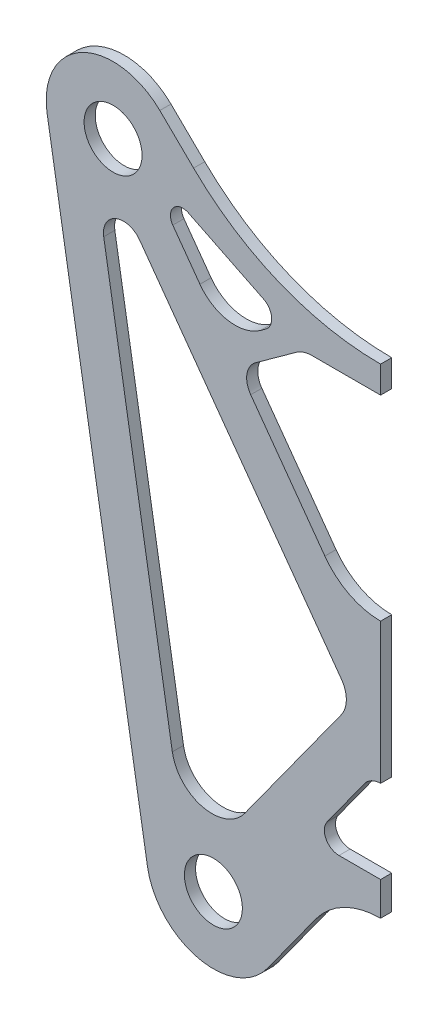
ISO-10303-21;
HEADER;
FILE_DESCRIPTION(('STEP AP214'),'2;1');
FILE_NAME('part.step','',(''),(''),'','','');
FILE_SCHEMA(('AUTOMOTIVE_DESIGN { 1 0 10303 214 1 1 1 1 }'));
ENDSEC;
DATA;
#1=APPLICATION_CONTEXT('core data for automotive mechanical design processes');
#2=APPLICATION_PROTOCOL_DEFINITION('international standard','automotive_design',2000,#1);
#3=PRODUCT_CONTEXT('',#1,'mechanical');
#4=PRODUCT('Part','Part','',(#3));
#5=PRODUCT_RELATED_PRODUCT_CATEGORY('part','',(#4));
#6=PRODUCT_DEFINITION_FORMATION('','',#4);
#7=PRODUCT_DEFINITION_CONTEXT('part definition',#1,'design');
#8=PRODUCT_DEFINITION('design','',#6,#7);
#9=PRODUCT_DEFINITION_SHAPE('','',#8);
#10=(LENGTH_UNIT() NAMED_UNIT(*) SI_UNIT(.MILLI.,.METRE.));
#11=(NAMED_UNIT(*) PLANE_ANGLE_UNIT() SI_UNIT($,.RADIAN.));
#12=(NAMED_UNIT(*) SI_UNIT($,.STERADIAN.) SOLID_ANGLE_UNIT());
#13=UNCERTAINTY_MEASURE_WITH_UNIT(LENGTH_MEASURE(1.E-05),#10,'distance_accuracy_value','');
#14=(GEOMETRIC_REPRESENTATION_CONTEXT(3) GLOBAL_UNCERTAINTY_ASSIGNED_CONTEXT((#13)) GLOBAL_UNIT_ASSIGNED_CONTEXT((#10,
#11,#12)) REPRESENTATION_CONTEXT('',''));
#15=CARTESIAN_POINT('',(0.,0.,0.));
#16=DIRECTION('',(0.,0.,1.));
#17=DIRECTION('',(1.,0.,0.));
#18=AXIS2_PLACEMENT_3D('',#15,#16,#17);
#19=CARTESIAN_POINT('',(-188.917466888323,32.6227205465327,5.));
#20=DIRECTION('',(0.,0.,-1.));
#21=DIRECTION('',(-1.,0.,0.));
#22=AXIS2_PLACEMENT_3D('',#19,#20,#21);
#23=PLANE('',#22);
#24=CARTESIAN_POINT('',(-157.627108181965,15.7153193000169,5.));
#25=DIRECTION('',(0.,0.,1.));
#26=DIRECTION('',(-1.,0.,0.));
#27=AXIS2_PLACEMENT_3D('',#24,#25,#26);
#28=CIRCLE('',#27,5.56609009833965);
#29=CARTESIAN_POINT('',(-155.167864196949,20.7086626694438,5.));
#30=VERTEX_POINT('',#29);
#31=CARTESIAN_POINT('',(-162.139421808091,12.4564261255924,5.));
#32=VERTEX_POINT('',#31);
#33=EDGE_CURVE('E291',#30,#32,#28,.T.);
#34=ORIENTED_EDGE('',*,*,#33,.F.);
#35=DIRECTION('',(-0.89710070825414,0.441826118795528,0.));
#36=VECTOR('',#35,1.);
#37=CARTESIAN_POINT('',(-155.167864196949,20.7086626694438,5.));
#38=LINE('',#37,#36);
#39=CARTESIAN_POINT('',(-121.443837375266,4.09942833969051,5.));
#40=VERTEX_POINT('',#39);
#41=EDGE_CURVE('E303',#40,#30,#38,.T.);
#42=ORIENTED_EDGE('',*,*,#41,.F.);
#43=CARTESIAN_POINT('',(-124.352985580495,-1.80741782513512,5.));
#44=DIRECTION('',(0.,0.,1.));
#45=DIRECTION('',(-1.,0.,0.));
#46=AXIS2_PLACEMENT_3D('',#43,#44,#45);
#47=CIRCLE('',#46,6.58437353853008);
#48=CARTESIAN_POINT('',(-120.497897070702,-7.14523268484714,5.));
#49=VERTEX_POINT('',#48);
#50=EDGE_CURVE('E300',#49,#40,#47,.T.);
#51=ORIENTED_EDGE('',*,*,#50,.F.);
#52=DIRECTION('',(0.81067922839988,0.585490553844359,0.));
#53=VECTOR('',#52,1.);
#54=CARTESIAN_POINT('',(-120.497897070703,-7.14523268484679,5.));
#55=LINE('',#54,#53);
#56=CARTESIAN_POINT('',(-122.787009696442,-8.79848069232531,5.));
#57=VERTEX_POINT('',#56);
#58=EDGE_CURVE('E298',#57,#49,#55,.T.);
#59=ORIENTED_EDGE('',*,*,#58,.F.);
#60=CARTESIAN_POINT('',(-134.179271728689,6.9754205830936,5.));
#61=DIRECTION('',(0.,0.,1.));
#62=DIRECTION('',(-1.,0.,0.));
#63=AXIS2_PLACEMENT_3D('',#60,#61,#62);
#64=CIRCLE('',#63,19.4576359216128);
#65=CARTESIAN_POINT('',(-149.953173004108,-4.41684144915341,5.));
#66=VERTEX_POINT('',#65);
#67=EDGE_CURVE('E296',#66,#57,#64,.T.);
#68=ORIENTED_EDGE('',*,*,#67,.F.);
#69=DIRECTION('',(0.585490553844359,-0.81067922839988,0.));
#70=VECTOR('',#69,1.);
#71=CARTESIAN_POINT('',(-149.953173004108,-4.4168414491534,5.));
#72=LINE('',#71,#70);
#73=EDGE_CURVE('E293',#32,#66,#72,.T.);
#74=ORIENTED_EDGE('',*,*,#73,.F.);
#75=EDGE_LOOP('',(#34,#42,#51,#59,#68,#74));
#76=FACE_BOUND('',#75,.T.);
#77=CARTESIAN_POINT('',(-188.917466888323,32.6227205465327,5.));
#78=DIRECTION('',(0.,0.,1.));
#79=DIRECTION('',(1.,0.,0.));
#80=AXIS2_PLACEMENT_3D('',#77,#78,#79);
#81=CIRCLE('',#80,13.0000000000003);
#82=CARTESIAN_POINT('',(-175.917466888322,32.6227205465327,5.));
#83=VERTEX_POINT('',#82);
#84=EDGE_CURVE('E342',#83,#83,#81,.T.);
#85=ORIENTED_EDGE('',*,*,#84,.F.);
#86=EDGE_LOOP('',(#85));
#87=FACE_BOUND('',#86,.T.);
#88=CARTESIAN_POINT('',(-188.917466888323,32.6227205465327,5.));
#89=DIRECTION('',(0.,0.,1.));
#90=DIRECTION('',(-1.,0.,0.));
#91=AXIS2_PLACEMENT_3D('',#88,#89,#90);
#92=CIRCLE('',#91,29.9999999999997);
#93=CARTESIAN_POINT('',(-167.942066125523,54.071090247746,5.));
#94=VERTEX_POINT('',#93);
#95=CARTESIAN_POINT('',(-218.509284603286,27.6907509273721,5.));
#96=VERTEX_POINT('',#95);
#97=EDGE_CURVE('E348',#94,#96,#92,.T.);
#98=ORIENTED_EDGE('',*,*,#97,.T.);
#99=DIRECTION('',(0.164398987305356,-0.986393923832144,0.));
#100=VECTOR('',#99,1.);
#101=CARTESIAN_POINT('',(-173.509284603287,-242.309249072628,5.));
#102=LINE('',#101,#100);
#103=CARTESIAN_POINT('',(-173.509284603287,-242.309249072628,5.));
#104=VERTEX_POINT('',#103);
#105=EDGE_CURVE('E351',#96,#104,#102,.T.);
#106=ORIENTED_EDGE('',*,*,#105,.T.);
#107=CARTESIAN_POINT('',(-143.917466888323,-237.377279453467,5.));
#108=DIRECTION('',(0.,0.,1.));
#109=DIRECTION('',(-1.,0.,0.));
#110=AXIS2_PLACEMENT_3D('',#107,#108,#109);
#111=CIRCLE('',#110,30.);
#112=CARTESIAN_POINT('',(-119.597090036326,-254.941996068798,5.));
#113=VERTEX_POINT('',#112);
#114=EDGE_CURVE('E354',#104,#113,#111,.T.);
#115=ORIENTED_EDGE('',*,*,#114,.T.);
#116=DIRECTION('',(0.585490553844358,0.810679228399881,0.));
#117=VECTOR('',#116,1.);
#118=CARTESIAN_POINT('',(-119.597090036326,-254.941996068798,5.));
#119=LINE('',#118,#117);
#120=CARTESIAN_POINT('',(-98.0453078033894,-225.101066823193,5.));
#121=VERTEX_POINT('',#120);
#122=EDGE_CURVE('E356',#113,#121,#119,.T.);
#123=ORIENTED_EDGE('',*,*,#122,.T.);
#124=CARTESIAN_POINT('',(-68.9174668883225,-246.137840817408,5.));
#125=DIRECTION('',(0.,0.,-1.));
#126=DIRECTION('',(-1.,0.,0.));
#127=AXIS2_PLACEMENT_3D('',#124,#125,#126);
#128=CIRCLE('',#127,35.9301680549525);
#129=CARTESIAN_POINT('',(-68.9174668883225,-210.207672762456,5.));
#130=VERTEX_POINT('',#129);
#131=EDGE_CURVE('E358',#121,#130,#128,.T.);
#132=ORIENTED_EDGE('',*,*,#131,.T.);
#133=DIRECTION('',(0.,1.,0.));
#134=VECTOR('',#133,1.);
#135=CARTESIAN_POINT('',(-68.9174668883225,-195.150864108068,5.));
#136=LINE('',#135,#134);
#137=CARTESIAN_POINT('',(-68.9174668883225,-195.150864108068,5.));
#138=VERTEX_POINT('',#137);
#139=EDGE_CURVE('E360',#130,#138,#136,.T.);
#140=ORIENTED_EDGE('',*,*,#139,.T.);
#141=DIRECTION('',(-1.,0.,0.));
#142=VECTOR('',#141,1.);
#143=CARTESIAN_POINT('',(-87.5763823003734,-195.150864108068,5.));
#144=LINE('',#143,#142);
#145=CARTESIAN_POINT('',(-87.5763823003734,-195.150864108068,5.));
#146=VERTEX_POINT('',#145);
#147=EDGE_CURVE('E362',#138,#146,#144,.T.);
#148=ORIENTED_EDGE('',*,*,#147,.T.);
#149=CARTESIAN_POINT('',(-87.5763823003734,-188.581284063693,5.));
#150=DIRECTION('',(0.,0.,-1.));
#151=DIRECTION('',(1.,0.,0.));
#152=AXIS2_PLACEMENT_3D('',#149,#150,#151);
#153=CIRCLE('',#152,6.56958004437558);
#154=CARTESIAN_POINT('',(-92.9022043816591,-184.734857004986,5.));
#155=VERTEX_POINT('',#154);
#156=EDGE_CURVE('E364',#146,#155,#153,.T.);
#157=ORIENTED_EDGE('',*,*,#156,.T.);
#158=DIRECTION('',(0.585490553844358,0.810679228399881,0.));
#159=VECTOR('',#158,1.);
#160=CARTESIAN_POINT('',(-76.1281513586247,-161.509245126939,5.));
#161=LINE('',#160,#159);
#162=CARTESIAN_POINT('',(-76.1281513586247,-161.509245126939,5.));
#163=VERTEX_POINT('',#162);
#164=EDGE_CURVE('E366',#155,#163,#161,.T.);
#165=ORIENTED_EDGE('',*,*,#164,.T.);
#166=CARTESIAN_POINT('',(-68.9174668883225,-166.716961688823,5.));
#167=DIRECTION('',(0.,0.,-1.));
#168=DIRECTION('',(-1.,0.,0.));
#169=AXIS2_PLACEMENT_3D('',#166,#167,#168);
#170=CIRCLE('',#169,8.89462097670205);
#171=CARTESIAN_POINT('',(-68.9174668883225,-157.822340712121,5.));
#172=VERTEX_POINT('',#171);
#173=EDGE_CURVE('E368',#163,#172,#170,.T.);
#174=ORIENTED_EDGE('',*,*,#173,.T.);
#175=DIRECTION('',(0.,1.,0.));
#176=VECTOR('',#175,1.);
#177=CARTESIAN_POINT('',(-68.9174668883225,-94.7875246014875,5.));
#178=LINE('',#177,#176);
#179=CARTESIAN_POINT('',(-68.9174668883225,-94.7875246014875,5.));
#180=VERTEX_POINT('',#179);
#181=EDGE_CURVE('E370',#172,#180,#178,.T.);
#182=ORIENTED_EDGE('',*,*,#181,.T.);
#183=CARTESIAN_POINT('',(-68.9174668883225,-63.9491866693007,5.));
#184=DIRECTION('',(0.,0.,-1.));
#185=DIRECTION('',(1.,0.,0.));
#186=AXIS2_PLACEMENT_3D('',#183,#184,#185);
#187=CIRCLE('',#186,30.8383379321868);
#188=CARTESIAN_POINT('',(-93.9174668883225,-82.0047422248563,5.));
#189=VERTEX_POINT('',#188);
#190=EDGE_CURVE('E372',#180,#189,#187,.T.);
#191=ORIENTED_EDGE('',*,*,#190,.T.);
#192=DIRECTION('',(-0.585490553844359,0.810679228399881,0.));
#193=VECTOR('',#192,1.);
#194=CARTESIAN_POINT('',(-127.175411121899,-35.955280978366,5.));
#195=LINE('',#194,#193);
#196=CARTESIAN_POINT('',(-127.175411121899,-35.955280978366,5.));
#197=VERTEX_POINT('',#196);
#198=EDGE_CURVE('E374',#189,#197,#195,.T.);
#199=ORIENTED_EDGE('',*,*,#198,.T.);
#200=CARTESIAN_POINT('',(-119.3375843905,-30.2946283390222,5.));
#201=DIRECTION('',(0.,0.,-1.));
#202=DIRECTION('',(1.,0.,0.));
#203=AXIS2_PLACEMENT_3D('',#200,#201,#202);
#204=CIRCLE('',#203,9.66822197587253);
#205=CARTESIAN_POINT('',(-124.998237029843,-22.4568016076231,5.));
#206=VERTEX_POINT('',#205);
#207=EDGE_CURVE('E376',#197,#206,#204,.T.);
#208=ORIENTED_EDGE('',*,*,#207,.T.);
#209=DIRECTION('',(0.810679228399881,0.585490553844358,0.));
#210=VECTOR('',#209,1.);
#211=CARTESIAN_POINT('',(-106.712824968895,-9.25067067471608,5.));
#212=LINE('',#211,#210);
#213=CARTESIAN_POINT('',(-106.712824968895,-9.25067067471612,5.));
#214=VERTEX_POINT('',#213);
#215=EDGE_CURVE('E378',#206,#214,#212,.T.);
#216=ORIENTED_EDGE('',*,*,#215,.T.);
#217=CARTESIAN_POINT('',(-99.7671006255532,-18.8678274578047,5.));
#218=DIRECTION('',(0.,0.,-1.));
#219=DIRECTION('',(1.,0.,0.));
#220=AXIS2_PLACEMENT_3D('',#217,#218,#219);
#221=CIRCLE('',#220,11.8630852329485);
#222=CARTESIAN_POINT('',(-99.7671006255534,-7.00474222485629,5.));
#223=VERTEX_POINT('',#222);
#224=EDGE_CURVE('E380',#214,#223,#221,.T.);
#225=ORIENTED_EDGE('',*,*,#224,.T.);
#226=DIRECTION('',(1.,0.,0.));
#227=VECTOR('',#226,1.);
#228=CARTESIAN_POINT('',(-93.9174668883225,-7.00474222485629,5.));
#229=LINE('',#228,#227);
#230=CARTESIAN_POINT('',(-68.9174668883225,-7.00474222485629,5.));
#231=VERTEX_POINT('',#230);
#232=EDGE_CURVE('E382',#223,#231,#229,.T.);
#233=ORIENTED_EDGE('',*,*,#232,.T.);
#234=DIRECTION('',(0.,1.,0.));
#235=VECTOR('',#234,1.);
#236=CARTESIAN_POINT('',(-68.9174668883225,5.05807125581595,5.));
#237=LINE('',#236,#235);
#238=CARTESIAN_POINT('',(-68.9174668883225,5.05807125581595,5.));
#239=VERTEX_POINT('',#238);
#240=EDGE_CURVE('E384',#231,#239,#237,.T.);
#241=ORIENTED_EDGE('',*,*,#240,.T.);
#242=CARTESIAN_POINT('',(-68.9174668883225,125.015467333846,5.));
#243=DIRECTION('',(0.,0.,-1.));
#244=DIRECTION('',(1.,0.,0.));
#245=AXIS2_PLACEMENT_3D('',#242,#243,#244);
#246=CIRCLE('',#245,119.95739607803);
#247=CARTESIAN_POINT('',(-152.789282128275,39.2524480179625,5.));
#248=VERTEX_POINT('',#247);
#249=EDGE_CURVE('E386',#239,#248,#246,.T.);
#250=ORIENTED_EDGE('',*,*,#249,.T.);
#251=DIRECTION('',(-0.71494565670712,0.69918002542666,0.));
#252=VECTOR('',#251,1.);
#253=CARTESIAN_POINT('',(-167.942066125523,54.071090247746,5.));
#254=LINE('',#253,#252);
#255=EDGE_CURVE('E388',#248,#94,#254,.T.);
#256=ORIENTED_EDGE('',*,*,#255,.T.);
#257=EDGE_LOOP('',(#98,#106,#115,#123,#132,#140,#148,#157,#165,#174,#182,#191,#199,#208,#216,
#225,#233,#241,#250,#256));
#258=FACE_BOUND('',#257,.T.);
#259=CARTESIAN_POINT('',(-143.917466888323,-237.377279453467,5.));
#260=DIRECTION('',(0.,0.,1.));
#261=DIRECTION('',(1.,0.,0.));
#262=AXIS2_PLACEMENT_3D('',#259,#260,#261);
#263=CIRCLE('',#262,13.0000000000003);
#264=CARTESIAN_POINT('',(-130.917466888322,-237.377279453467,5.));
#265=VERTEX_POINT('',#264);
#266=EDGE_CURVE('E336',#265,#265,#263,.T.);
#267=ORIENTED_EDGE('',*,*,#266,.F.);
#268=EDGE_LOOP('',(#267));
#269=FACE_BOUND('',#268,.T.);
#270=CARTESIAN_POINT('',(-96.1325666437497,-132.989577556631,5.));
#271=DIRECTION('',(0.,0.,1.));
#272=DIRECTION('',(1.,0.,0.));
#273=AXIS2_PLACEMENT_3D('',#270,#271,#272);
#274=CIRCLE('',#273,11.8444147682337);
#275=CARTESIAN_POINT('',(-86.5305456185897,-139.924370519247,5.));
#276=VERTEX_POINT('',#275);
#277=CARTESIAN_POINT('',(-86.5305456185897,-126.054784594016,5.));
#278=VERTEX_POINT('',#277);
#279=EDGE_CURVE('E240',#276,#278,#274,.T.);
#280=ORIENTED_EDGE('',*,*,#279,.F.);
#281=DIRECTION('',(0.585490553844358,0.810679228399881,0.));
#282=VECTOR('',#281,1.);
#283=CARTESIAN_POINT('',(-129.83431078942,-199.88342998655,5.));
#284=LINE('',#283,#282);
#285=CARTESIAN_POINT('',(-129.83431078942,-199.88342998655,5.));
#286=VERTEX_POINT('',#285);
#287=EDGE_CURVE('E269',#286,#276,#284,.T.);
#288=ORIENTED_EDGE('',*,*,#287,.F.);
#289=CARTESIAN_POINT('',(-144.497286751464,-189.293502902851,5.));
#290=DIRECTION('',(0.,0.,1.));
#291=DIRECTION('',(1.,0.,0.));
#292=AXIS2_PLACEMENT_3D('',#289,#290,#291);
#293=CIRCLE('',#292,18.0872723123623);
#294=CARTESIAN_POINT('',(-162.338462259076,-192.26703215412,5.));
#295=VERTEX_POINT('',#294);
#296=EDGE_CURVE('E267',#295,#286,#293,.T.);
#297=ORIENTED_EDGE('',*,*,#296,.F.);
#298=DIRECTION('',(0.164398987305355,-0.986393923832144,0.));
#299=VECTOR('',#298,1.);
#300=CARTESIAN_POINT('',(-193.122920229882,-7.56028432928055,5.));
#301=LINE('',#300,#299);
#302=CARTESIAN_POINT('',(-193.122920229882,-7.56028432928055,5.));
#303=VERTEX_POINT('',#302);
#304=EDGE_CURVE('E263',#303,#295,#301,.T.);
#305=ORIENTED_EDGE('',*,*,#304,.F.);
#306=CARTESIAN_POINT('',(-184.260106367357,-6.08314868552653,5.));
#307=DIRECTION('',(0.,0.,1.));
#308=DIRECTION('',(1.,0.,0.));
#309=AXIS2_PLACEMENT_3D('',#306,#307,#308);
#310=CIRCLE('',#309,8.98506534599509);
#311=CARTESIAN_POINT('',(-176.976100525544,-0.822477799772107,5.));
#312=VERTEX_POINT('',#311);
#313=EDGE_CURVE('E261',#312,#303,#310,.T.);
#314=ORIENTED_EDGE('',*,*,#313,.F.);
#315=DIRECTION('',(-0.585490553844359,0.810679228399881,0.));
#316=VECTOR('',#315,1.);
#317=CARTESIAN_POINT('',(-86.5305456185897,-126.054784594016,5.));
#318=LINE('',#317,#316);
#319=EDGE_CURVE('E248',#278,#312,#318,.T.);
#320=ORIENTED_EDGE('',*,*,#319,.F.);
#321=EDGE_LOOP('',(#280,#288,#297,#305,#314,#320));
#322=FACE_BOUND('',#321,.T.);
#323=ADVANCED_FACE('F31',(#76,#87,#258,#269,#322),#23,.F.);
#324=CARTESIAN_POINT('',(-188.917466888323,32.6227205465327,0.));
#325=DIRECTION('',(0.,0.,-1.));
#326=DIRECTION('',(-1.,0.,0.));
#327=AXIS2_PLACEMENT_3D('',#324,#325,#326);
#328=PLANE('',#327);
#329=DIRECTION('',(-0.89710070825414,0.441826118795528,0.));
#330=VECTOR('',#329,1.);
#331=CARTESIAN_POINT('',(-155.167864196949,20.7086626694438,0.));
#332=LINE('',#331,#330);
#333=CARTESIAN_POINT('',(-121.443837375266,4.09942833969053,0.));
#334=VERTEX_POINT('',#333);
#335=CARTESIAN_POINT('',(-155.167864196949,20.7086626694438,0.));
#336=VERTEX_POINT('',#335);
#337=EDGE_CURVE('E294',#334,#336,#332,.T.);
#338=ORIENTED_EDGE('',*,*,#337,.T.);
#339=CARTESIAN_POINT('',(-157.627108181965,15.7153193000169,0.));
#340=DIRECTION('',(0.,0.,1.));
#341=DIRECTION('',(-1.,0.,0.));
#342=AXIS2_PLACEMENT_3D('',#339,#340,#341);
#343=CIRCLE('',#342,5.56609009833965);
#344=CARTESIAN_POINT('',(-162.139421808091,12.4564261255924,0.));
#345=VERTEX_POINT('',#344);
#346=EDGE_CURVE('E256',#336,#345,#343,.T.);
#347=ORIENTED_EDGE('',*,*,#346,.T.);
#348=DIRECTION('',(0.585490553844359,-0.81067922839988,0.));
#349=VECTOR('',#348,1.);
#350=CARTESIAN_POINT('',(-149.953173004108,-4.4168414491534,0.));
#351=LINE('',#350,#349);
#352=CARTESIAN_POINT('',(-149.953173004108,-4.41684144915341,0.));
#353=VERTEX_POINT('',#352);
#354=EDGE_CURVE('E308',#345,#353,#351,.T.);
#355=ORIENTED_EDGE('',*,*,#354,.T.);
#356=CARTESIAN_POINT('',(-134.179271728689,6.9754205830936,0.));
#357=DIRECTION('',(0.,0.,1.));
#358=DIRECTION('',(-1.,0.,0.));
#359=AXIS2_PLACEMENT_3D('',#356,#357,#358);
#360=CIRCLE('',#359,19.4576359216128);
#361=CARTESIAN_POINT('',(-122.787009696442,-8.79848069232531,0.));
#362=VERTEX_POINT('',#361);
#363=EDGE_CURVE('E311',#353,#362,#360,.T.);
#364=ORIENTED_EDGE('',*,*,#363,.T.);
#365=DIRECTION('',(0.81067922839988,0.585490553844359,0.));
#366=VECTOR('',#365,1.);
#367=CARTESIAN_POINT('',(-120.497897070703,-7.14523268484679,0.));
#368=LINE('',#367,#366);
#369=CARTESIAN_POINT('',(-120.497897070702,-7.14523268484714,0.));
#370=VERTEX_POINT('',#369);
#371=EDGE_CURVE('E314',#362,#370,#368,.T.);
#372=ORIENTED_EDGE('',*,*,#371,.T.);
#373=CARTESIAN_POINT('',(-124.352985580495,-1.80741782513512,0.));
#374=DIRECTION('',(0.,0.,1.));
#375=DIRECTION('',(-1.,0.,0.));
#376=AXIS2_PLACEMENT_3D('',#373,#374,#375);
#377=CIRCLE('',#376,6.58437353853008);
#378=EDGE_CURVE('E317',#370,#334,#377,.T.);
#379=ORIENTED_EDGE('',*,*,#378,.T.);
#380=EDGE_LOOP('',(#338,#347,#355,#364,#372,#379));
#381=FACE_BOUND('',#380,.T.);
#382=CARTESIAN_POINT('',(-188.917466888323,32.6227205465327,0.));
#383=DIRECTION('',(0.,0.,1.));
#384=DIRECTION('',(1.,0.,0.));
#385=AXIS2_PLACEMENT_3D('',#382,#383,#384);
#386=CIRCLE('',#385,13.0000000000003);
#387=CARTESIAN_POINT('',(-175.917466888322,32.6227205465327,0.));
#388=VERTEX_POINT('',#387);
#389=EDGE_CURVE('E339',#388,#388,#386,.T.);
#390=ORIENTED_EDGE('',*,*,#389,.T.);
#391=EDGE_LOOP('',(#390));
#392=FACE_BOUND('',#391,.T.);
#393=CARTESIAN_POINT('',(-188.917466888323,32.6227205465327,0.));
#394=DIRECTION('',(0.,0.,1.));
#395=DIRECTION('',(-1.,0.,0.));
#396=AXIS2_PLACEMENT_3D('',#393,#394,#395);
#397=CIRCLE('',#396,29.9999999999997);
#398=CARTESIAN_POINT('',(-167.942066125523,54.071090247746,0.));
#399=VERTEX_POINT('',#398);
#400=CARTESIAN_POINT('',(-218.509284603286,27.6907509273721,0.));
#401=VERTEX_POINT('',#400);
#402=EDGE_CURVE('E345',#399,#401,#397,.T.);
#403=ORIENTED_EDGE('',*,*,#402,.F.);
#404=DIRECTION('',(-0.71494565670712,0.69918002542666,0.));
#405=VECTOR('',#404,1.);
#406=CARTESIAN_POINT('',(-167.942066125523,54.071090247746,0.));
#407=LINE('',#406,#405);
#408=CARTESIAN_POINT('',(-152.789282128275,39.2524480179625,0.));
#409=VERTEX_POINT('',#408);
#410=EDGE_CURVE('E352',#409,#399,#407,.T.);
#411=ORIENTED_EDGE('',*,*,#410,.F.);
#412=CARTESIAN_POINT('',(-68.9174668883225,125.015467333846,0.));
#413=DIRECTION('',(0.,0.,-1.));
#414=DIRECTION('',(1.,0.,0.));
#415=AXIS2_PLACEMENT_3D('',#412,#413,#414);
#416=CIRCLE('',#415,119.95739607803);
#417=CARTESIAN_POINT('',(-68.9174668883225,5.05807125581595,0.));
#418=VERTEX_POINT('',#417);
#419=EDGE_CURVE('E428',#418,#409,#416,.T.);
#420=ORIENTED_EDGE('',*,*,#419,.F.);
#421=DIRECTION('',(0.,1.,0.));
#422=VECTOR('',#421,1.);
#423=CARTESIAN_POINT('',(-68.9174668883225,5.05807125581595,0.));
#424=LINE('',#423,#422);
#425=CARTESIAN_POINT('',(-68.9174668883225,-7.00474222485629,0.));
#426=VERTEX_POINT('',#425);
#427=EDGE_CURVE('E426',#426,#418,#424,.T.);
#428=ORIENTED_EDGE('',*,*,#427,.F.);
#429=DIRECTION('',(1.,0.,0.));
#430=VECTOR('',#429,1.);
#431=CARTESIAN_POINT('',(-68.9174668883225,-7.00474222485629,0.));
#432=LINE('',#431,#430);
#433=CARTESIAN_POINT('',(-99.7671006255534,-7.00474222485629,0.));
#434=VERTEX_POINT('',#433);
#435=EDGE_CURVE('E424',#434,#426,#432,.T.);
#436=ORIENTED_EDGE('',*,*,#435,.F.);
#437=CARTESIAN_POINT('',(-99.7671006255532,-18.8678274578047,0.));
#438=DIRECTION('',(0.,0.,-1.));
#439=DIRECTION('',(1.,0.,0.));
#440=AXIS2_PLACEMENT_3D('',#437,#438,#439);
#441=CIRCLE('',#440,11.8630852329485);
#442=CARTESIAN_POINT('',(-106.712824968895,-9.25067067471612,0.));
#443=VERTEX_POINT('',#442);
#444=EDGE_CURVE('E421',#443,#434,#441,.T.);
#445=ORIENTED_EDGE('',*,*,#444,.F.);
#446=DIRECTION('',(0.810679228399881,0.585490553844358,0.));
#447=VECTOR('',#446,1.);
#448=CARTESIAN_POINT('',(-106.712824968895,-9.25067067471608,0.));
#449=LINE('',#448,#447);
#450=CARTESIAN_POINT('',(-124.998237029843,-22.4568016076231,0.));
#451=VERTEX_POINT('',#450);
#452=EDGE_CURVE('E419',#451,#443,#449,.T.);
#453=ORIENTED_EDGE('',*,*,#452,.F.);
#454=CARTESIAN_POINT('',(-119.3375843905,-30.2946283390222,0.));
#455=DIRECTION('',(0.,0.,-1.));
#456=DIRECTION('',(1.,0.,0.));
#457=AXIS2_PLACEMENT_3D('',#454,#455,#456);
#458=CIRCLE('',#457,9.66822197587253);
#459=CARTESIAN_POINT('',(-127.175411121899,-35.955280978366,0.));
#460=VERTEX_POINT('',#459);
#461=EDGE_CURVE('E417',#460,#451,#458,.T.);
#462=ORIENTED_EDGE('',*,*,#461,.F.);
#463=DIRECTION('',(-0.585490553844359,0.810679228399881,0.));
#464=VECTOR('',#463,1.);
#465=CARTESIAN_POINT('',(-127.175411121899,-35.955280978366,0.));
#466=LINE('',#465,#464);
#467=CARTESIAN_POINT('',(-93.9174668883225,-82.0047422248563,0.));
#468=VERTEX_POINT('',#467);
#469=EDGE_CURVE('E415',#468,#460,#466,.T.);
#470=ORIENTED_EDGE('',*,*,#469,.F.);
#471=CARTESIAN_POINT('',(-68.9174668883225,-63.9491866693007,0.));
#472=DIRECTION('',(0.,0.,-1.));
#473=DIRECTION('',(1.,0.,0.));
#474=AXIS2_PLACEMENT_3D('',#471,#472,#473);
#475=CIRCLE('',#474,30.8383379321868);
#476=CARTESIAN_POINT('',(-68.9174668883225,-94.7875246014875,0.));
#477=VERTEX_POINT('',#476);
#478=EDGE_CURVE('E413',#477,#468,#475,.T.);
#479=ORIENTED_EDGE('',*,*,#478,.F.);
#480=DIRECTION('',(0.,1.,0.));
#481=VECTOR('',#480,1.);
#482=CARTESIAN_POINT('',(-68.9174668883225,-94.7875246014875,0.));
#483=LINE('',#482,#481);
#484=CARTESIAN_POINT('',(-68.9174668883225,-157.822340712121,0.));
#485=VERTEX_POINT('',#484);
#486=EDGE_CURVE('E411',#485,#477,#483,.T.);
#487=ORIENTED_EDGE('',*,*,#486,.F.);
#488=CARTESIAN_POINT('',(-68.9174668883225,-166.716961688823,0.));
#489=DIRECTION('',(0.,0.,-1.));
#490=DIRECTION('',(-1.,0.,0.));
#491=AXIS2_PLACEMENT_3D('',#488,#489,#490);
#492=CIRCLE('',#491,8.89462097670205);
#493=CARTESIAN_POINT('',(-76.1281513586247,-161.509245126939,0.));
#494=VERTEX_POINT('',#493);
#495=EDGE_CURVE('E409',#494,#485,#492,.T.);
#496=ORIENTED_EDGE('',*,*,#495,.F.);
#497=DIRECTION('',(0.585490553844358,0.810679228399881,0.));
#498=VECTOR('',#497,1.);
#499=CARTESIAN_POINT('',(-76.1281513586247,-161.509245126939,0.));
#500=LINE('',#499,#498);
#501=CARTESIAN_POINT('',(-92.9022043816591,-184.734857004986,0.));
#502=VERTEX_POINT('',#501);
#503=EDGE_CURVE('E407',#502,#494,#500,.T.);
#504=ORIENTED_EDGE('',*,*,#503,.F.);
#505=CARTESIAN_POINT('',(-87.5763823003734,-188.581284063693,0.));
#506=DIRECTION('',(0.,0.,-1.));
#507=DIRECTION('',(1.,0.,0.));
#508=AXIS2_PLACEMENT_3D('',#505,#506,#507);
#509=CIRCLE('',#508,6.56958004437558);
#510=CARTESIAN_POINT('',(-87.5763823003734,-195.150864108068,0.));
#511=VERTEX_POINT('',#510);
#512=EDGE_CURVE('E405',#511,#502,#509,.T.);
#513=ORIENTED_EDGE('',*,*,#512,.F.);
#514=DIRECTION('',(-1.,0.,0.));
#515=VECTOR('',#514,1.);
#516=CARTESIAN_POINT('',(-87.5763823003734,-195.150864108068,0.));
#517=LINE('',#516,#515);
#518=CARTESIAN_POINT('',(-68.9174668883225,-195.150864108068,0.));
#519=VERTEX_POINT('',#518);
#520=EDGE_CURVE('E403',#519,#511,#517,.T.);
#521=ORIENTED_EDGE('',*,*,#520,.F.);
#522=DIRECTION('',(0.,1.,0.));
#523=VECTOR('',#522,1.);
#524=CARTESIAN_POINT('',(-68.9174668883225,-195.150864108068,0.));
#525=LINE('',#524,#523);
#526=CARTESIAN_POINT('',(-68.9174668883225,-210.207672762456,0.));
#527=VERTEX_POINT('',#526);
#528=EDGE_CURVE('E401',#527,#519,#525,.T.);
#529=ORIENTED_EDGE('',*,*,#528,.F.);
#530=CARTESIAN_POINT('',(-68.9174668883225,-246.137840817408,0.));
#531=DIRECTION('',(0.,0.,-1.));
#532=DIRECTION('',(-1.,0.,0.));
#533=AXIS2_PLACEMENT_3D('',#530,#531,#532);
#534=CIRCLE('',#533,35.9301680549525);
#535=CARTESIAN_POINT('',(-98.0453078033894,-225.101066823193,0.));
#536=VERTEX_POINT('',#535);
#537=EDGE_CURVE('E399',#536,#527,#534,.T.);
#538=ORIENTED_EDGE('',*,*,#537,.F.);
#539=DIRECTION('',(0.585490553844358,0.810679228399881,0.));
#540=VECTOR('',#539,1.);
#541=CARTESIAN_POINT('',(-119.597090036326,-254.941996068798,0.));
#542=LINE('',#541,#540);
#543=CARTESIAN_POINT('',(-119.597090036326,-254.941996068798,0.));
#544=VERTEX_POINT('',#543);
#545=EDGE_CURVE('E397',#544,#536,#542,.T.);
#546=ORIENTED_EDGE('',*,*,#545,.F.);
#547=CARTESIAN_POINT('',(-143.917466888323,-237.377279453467,0.));
#548=DIRECTION('',(0.,0.,1.));
#549=DIRECTION('',(-1.,0.,0.));
#550=AXIS2_PLACEMENT_3D('',#547,#548,#549);
#551=CIRCLE('',#550,30.);
#552=CARTESIAN_POINT('',(-173.509284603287,-242.309249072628,0.));
#553=VERTEX_POINT('',#552);
#554=EDGE_CURVE('E395',#553,#544,#551,.T.);
#555=ORIENTED_EDGE('',*,*,#554,.F.);
#556=DIRECTION('',(0.164398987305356,-0.986393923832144,0.));
#557=VECTOR('',#556,1.);
#558=CARTESIAN_POINT('',(-173.509284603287,-242.309249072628,0.));
#559=LINE('',#558,#557);
#560=EDGE_CURVE('E393',#401,#553,#559,.T.);
#561=ORIENTED_EDGE('',*,*,#560,.F.);
#562=EDGE_LOOP('',(#403,#411,#420,#428,#436,#445,#453,#462,#470,#479,#487,#496,#504,#513,#521,
#529,#538,#546,#555,#561));
#563=FACE_BOUND('',#562,.T.);
#564=CARTESIAN_POINT('',(-143.917466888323,-237.377279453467,0.));
#565=DIRECTION('',(0.,0.,1.));
#566=DIRECTION('',(1.,0.,0.));
#567=AXIS2_PLACEMENT_3D('',#564,#565,#566);
#568=CIRCLE('',#567,13.0000000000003);
#569=CARTESIAN_POINT('',(-130.917466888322,-237.377279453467,0.));
#570=VERTEX_POINT('',#569);
#571=EDGE_CURVE('E335',#570,#570,#568,.T.);
#572=ORIENTED_EDGE('',*,*,#571,.T.);
#573=EDGE_LOOP('',(#572));
#574=FACE_BOUND('',#573,.T.);
#575=DIRECTION('',(0.585490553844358,0.810679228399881,0.));
#576=VECTOR('',#575,1.);
#577=CARTESIAN_POINT('',(-129.83431078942,-199.88342998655,0.));
#578=LINE('',#577,#576);
#579=CARTESIAN_POINT('',(-129.83431078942,-199.88342998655,0.));
#580=VERTEX_POINT('',#579);
#581=CARTESIAN_POINT('',(-86.5305456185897,-139.924370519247,0.));
#582=VERTEX_POINT('',#581);
#583=EDGE_CURVE('E249',#580,#582,#578,.T.);
#584=ORIENTED_EDGE('',*,*,#583,.T.);
#585=CARTESIAN_POINT('',(-96.1325666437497,-132.989577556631,0.));
#586=DIRECTION('',(0.,0.,1.));
#587=DIRECTION('',(1.,0.,0.));
#588=AXIS2_PLACEMENT_3D('',#585,#586,#587);
#589=CIRCLE('',#588,11.8444147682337);
#590=CARTESIAN_POINT('',(-86.5305456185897,-126.054784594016,0.));
#591=VERTEX_POINT('',#590);
#592=EDGE_CURVE('E54',#582,#591,#589,.T.);
#593=ORIENTED_EDGE('',*,*,#592,.T.);
#594=DIRECTION('',(-0.585490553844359,0.810679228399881,0.));
#595=VECTOR('',#594,1.);
#596=CARTESIAN_POINT('',(-86.5305456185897,-126.054784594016,0.));
#597=LINE('',#596,#595);
#598=CARTESIAN_POINT('',(-176.976100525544,-0.822477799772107,0.));
#599=VERTEX_POINT('',#598);
#600=EDGE_CURVE('E255',#591,#599,#597,.T.);
#601=ORIENTED_EDGE('',*,*,#600,.T.);
#602=CARTESIAN_POINT('',(-184.260106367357,-6.08314868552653,0.));
#603=DIRECTION('',(0.,0.,1.));
#604=DIRECTION('',(1.,0.,0.));
#605=AXIS2_PLACEMENT_3D('',#602,#603,#604);
#606=CIRCLE('',#605,8.98506534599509);
#607=CARTESIAN_POINT('',(-193.122920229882,-7.56028432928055,0.));
#608=VERTEX_POINT('',#607);
#609=EDGE_CURVE('E273',#599,#608,#606,.T.);
#610=ORIENTED_EDGE('',*,*,#609,.T.);
#611=DIRECTION('',(0.164398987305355,-0.986393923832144,0.));
#612=VECTOR('',#611,1.);
#613=CARTESIAN_POINT('',(-193.122920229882,-7.56028432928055,0.));
#614=LINE('',#613,#612);
#615=CARTESIAN_POINT('',(-162.338462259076,-192.26703215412,0.));
#616=VERTEX_POINT('',#615);
#617=EDGE_CURVE('E276',#608,#616,#614,.T.);
#618=ORIENTED_EDGE('',*,*,#617,.T.);
#619=CARTESIAN_POINT('',(-144.497286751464,-189.293502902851,0.));
#620=DIRECTION('',(0.,0.,1.));
#621=DIRECTION('',(1.,0.,0.));
#622=AXIS2_PLACEMENT_3D('',#619,#620,#621);
#623=CIRCLE('',#622,18.0872723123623);
#624=EDGE_CURVE('E279',#616,#580,#623,.T.);
#625=ORIENTED_EDGE('',*,*,#624,.T.);
#626=EDGE_LOOP('',(#584,#593,#601,#610,#618,#625));
#627=FACE_BOUND('',#626,.T.);
#628=ADVANCED_FACE('F494',(#381,#392,#563,#574,#627),#328,.T.);
#629=CARTESIAN_POINT('',(-188.917466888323,32.6227205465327,5.));
#630=DIRECTION('',(0.,0.,-1.));
#631=DIRECTION('',(-1.,0.,0.));
#632=AXIS2_PLACEMENT_3D('',#629,#630,#631);
#633=CYLINDRICAL_SURFACE('',#632,29.9999999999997);
#634=ORIENTED_EDGE('',*,*,#402,.T.);
#635=DIRECTION('',(0.,0.,-1.));
#636=VECTOR('',#635,1.);
#637=CARTESIAN_POINT('',(-218.509284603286,27.6907509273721,5.));
#638=LINE('',#637,#636);
#639=EDGE_CURVE('E11',#96,#401,#638,.T.);
#640=ORIENTED_EDGE('',*,*,#639,.F.);
#641=ORIENTED_EDGE('',*,*,#97,.F.);
#642=DIRECTION('',(0.,0.,-1.));
#643=VECTOR('',#642,1.);
#644=CARTESIAN_POINT('',(-167.942066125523,54.071090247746,5.));
#645=LINE('',#644,#643);
#646=EDGE_CURVE('E390',#94,#399,#645,.T.);
#647=ORIENTED_EDGE('',*,*,#646,.T.);
#648=EDGE_LOOP('',(#634,#640,#641,#647));
#649=FACE_BOUND('',#648,.T.);
#650=ADVANCED_FACE('F33',(#649),#633,.T.);
#651=CARTESIAN_POINT('',(-173.509284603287,-242.309249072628,5.));
#652=DIRECTION('',(0.986393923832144,0.164398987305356,0.));
#653=DIRECTION('',(-0.164398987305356,0.986393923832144,0.));
#654=AXIS2_PLACEMENT_3D('',#651,#652,#653);
#655=PLANE('',#654);
#656=ORIENTED_EDGE('',*,*,#560,.T.);
#657=DIRECTION('',(0.,0.,-1.));
#658=VECTOR('',#657,1.);
#659=CARTESIAN_POINT('',(-173.509284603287,-242.309249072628,5.));
#660=LINE('',#659,#658);
#661=EDGE_CURVE('E39',#104,#553,#660,.T.);
#662=ORIENTED_EDGE('',*,*,#661,.F.);
#663=ORIENTED_EDGE('',*,*,#105,.F.);
#664=ORIENTED_EDGE('',*,*,#639,.T.);
#665=EDGE_LOOP('',(#656,#662,#663,#664));
#666=FACE_BOUND('',#665,.T.);
#667=ADVANCED_FACE('F512',(#666),#655,.F.);
#668=CARTESIAN_POINT('',(-143.917466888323,-237.377279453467,5.));
#669=DIRECTION('',(0.,0.,-1.));
#670=DIRECTION('',(-1.,0.,0.));
#671=AXIS2_PLACEMENT_3D('',#668,#669,#670);
#672=CYLINDRICAL_SURFACE('',#671,30.);
#673=ORIENTED_EDGE('',*,*,#554,.T.);
#674=DIRECTION('',(0.,0.,-1.));
#675=VECTOR('',#674,1.);
#676=CARTESIAN_POINT('',(-119.597090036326,-254.941996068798,5.));
#677=LINE('',#676,#675);
#678=EDGE_CURVE('E481',#113,#544,#677,.T.);
#679=ORIENTED_EDGE('',*,*,#678,.F.);
#680=ORIENTED_EDGE('',*,*,#114,.F.);
#681=ORIENTED_EDGE('',*,*,#661,.T.);
#682=EDGE_LOOP('',(#673,#679,#680,#681));
#683=FACE_BOUND('',#682,.T.);
#684=ADVANCED_FACE('F488',(#683),#672,.T.);
#685=CARTESIAN_POINT('',(-119.597090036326,-254.941996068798,5.));
#686=DIRECTION('',(-0.810679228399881,0.585490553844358,0.));
#687=DIRECTION('',(-0.585490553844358,-0.810679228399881,0.));
#688=AXIS2_PLACEMENT_3D('',#685,#686,#687);
#689=PLANE('',#688);
#690=ORIENTED_EDGE('',*,*,#545,.T.);
#691=DIRECTION('',(0.,0.,-1.));
#692=VECTOR('',#691,1.);
#693=CARTESIAN_POINT('',(-98.0453078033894,-225.101066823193,5.));
#694=LINE('',#693,#692);
#695=EDGE_CURVE('E478',#121,#536,#694,.T.);
#696=ORIENTED_EDGE('',*,*,#695,.F.);
#697=ORIENTED_EDGE('',*,*,#122,.F.);
#698=ORIENTED_EDGE('',*,*,#678,.T.);
#699=EDGE_LOOP('',(#690,#696,#697,#698));
#700=FACE_BOUND('',#699,.T.);
#701=ADVANCED_FACE('F500',(#700),#689,.F.);
#702=CARTESIAN_POINT('',(-68.9174668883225,-246.137840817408,5.));
#703=DIRECTION('',(0.,0.,-1.));
#704=DIRECTION('',(-1.,0.,0.));
#705=AXIS2_PLACEMENT_3D('',#702,#703,#704);
#706=CYLINDRICAL_SURFACE('',#705,35.9301680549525);
#707=ORIENTED_EDGE('',*,*,#537,.T.);
#708=DIRECTION('',(0.,0.,-1.));
#709=VECTOR('',#708,1.);
#710=CARTESIAN_POINT('',(-68.9174668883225,-210.207672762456,5.));
#711=LINE('',#710,#709);
#712=EDGE_CURVE('E475',#130,#527,#711,.T.);
#713=ORIENTED_EDGE('',*,*,#712,.F.);
#714=ORIENTED_EDGE('',*,*,#131,.F.);
#715=ORIENTED_EDGE('',*,*,#695,.T.);
#716=EDGE_LOOP('',(#707,#713,#714,#715));
#717=FACE_BOUND('',#716,.T.);
#718=ADVANCED_FACE('F504',(#717),#706,.F.);
#719=CARTESIAN_POINT('',(-68.9174668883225,-195.150864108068,5.));
#720=DIRECTION('',(-1.,0.,0.));
#721=DIRECTION('',(0.,-1.,0.));
#722=AXIS2_PLACEMENT_3D('',#719,#720,#721);
#723=PLANE('',#722);
#724=ORIENTED_EDGE('',*,*,#528,.T.);
#725=DIRECTION('',(0.,0.,-1.));
#726=VECTOR('',#725,1.);
#727=CARTESIAN_POINT('',(-68.9174668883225,-195.150864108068,5.));
#728=LINE('',#727,#726);
#729=EDGE_CURVE('E472',#138,#519,#728,.T.);
#730=ORIENTED_EDGE('',*,*,#729,.F.);
#731=ORIENTED_EDGE('',*,*,#139,.F.);
#732=ORIENTED_EDGE('',*,*,#712,.T.);
#733=EDGE_LOOP('',(#724,#730,#731,#732));
#734=FACE_BOUND('',#733,.T.);
#735=ADVANCED_FACE('F584',(#734),#723,.F.);
#736=CARTESIAN_POINT('',(-87.5763823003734,-195.150864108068,5.));
#737=DIRECTION('',(0.,-1.,0.));
#738=DIRECTION('',(0.,0.,-1.));
#739=AXIS2_PLACEMENT_3D('',#736,#737,#738);
#740=PLANE('',#739);
#741=ORIENTED_EDGE('',*,*,#520,.T.);
#742=DIRECTION('',(0.,0.,-1.));
#743=VECTOR('',#742,1.);
#744=CARTESIAN_POINT('',(-87.5763823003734,-195.150864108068,5.));
#745=LINE('',#744,#743);
#746=EDGE_CURVE('E469',#146,#511,#745,.T.);
#747=ORIENTED_EDGE('',*,*,#746,.F.);
#748=ORIENTED_EDGE('',*,*,#147,.F.);
#749=ORIENTED_EDGE('',*,*,#729,.T.);
#750=EDGE_LOOP('',(#741,#747,#748,#749));
#751=FACE_BOUND('',#750,.T.);
#752=ADVANCED_FACE('F582',(#751),#740,.F.);
#753=CARTESIAN_POINT('',(-87.5763823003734,-188.581284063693,5.));
#754=DIRECTION('',(0.,0.,-1.));
#755=DIRECTION('',(-1.,0.,0.));
#756=AXIS2_PLACEMENT_3D('',#753,#754,#755);
#757=CYLINDRICAL_SURFACE('',#756,6.56958004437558);
#758=ORIENTED_EDGE('',*,*,#512,.T.);
#759=DIRECTION('',(0.,0.,-1.));
#760=VECTOR('',#759,1.);
#761=CARTESIAN_POINT('',(-92.9022043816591,-184.734857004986,5.));
#762=LINE('',#761,#760);
#763=EDGE_CURVE('E466',#155,#502,#762,.T.);
#764=ORIENTED_EDGE('',*,*,#763,.F.);
#765=ORIENTED_EDGE('',*,*,#156,.F.);
#766=ORIENTED_EDGE('',*,*,#746,.T.);
#767=EDGE_LOOP('',(#758,#764,#765,#766));
#768=FACE_BOUND('',#767,.T.);
#769=ADVANCED_FACE('F577',(#768),#757,.F.);
#770=CARTESIAN_POINT('',(-76.1281513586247,-161.509245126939,5.));
#771=DIRECTION('',(-0.810679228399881,0.585490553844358,0.));
#772=DIRECTION('',(-0.585490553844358,-0.810679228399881,0.));
#773=AXIS2_PLACEMENT_3D('',#770,#771,#772);
#774=PLANE('',#773);
#775=ORIENTED_EDGE('',*,*,#503,.T.);
#776=DIRECTION('',(0.,0.,-1.));
#777=VECTOR('',#776,1.);
#778=CARTESIAN_POINT('',(-76.1281513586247,-161.509245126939,5.));
#779=LINE('',#778,#777);
#780=EDGE_CURVE('E463',#163,#494,#779,.T.);
#781=ORIENTED_EDGE('',*,*,#780,.F.);
#782=ORIENTED_EDGE('',*,*,#164,.F.);
#783=ORIENTED_EDGE('',*,*,#763,.T.);
#784=EDGE_LOOP('',(#775,#781,#782,#783));
#785=FACE_BOUND('',#784,.T.);
#786=ADVANCED_FACE('F572',(#785),#774,.F.);
#787=CARTESIAN_POINT('',(-68.9174668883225,-166.716961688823,5.));
#788=DIRECTION('',(0.,0.,-1.));
#789=DIRECTION('',(-1.,0.,0.));
#790=AXIS2_PLACEMENT_3D('',#787,#788,#789);
#791=CYLINDRICAL_SURFACE('',#790,8.89462097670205);
#792=ORIENTED_EDGE('',*,*,#495,.T.);
#793=DIRECTION('',(0.,0.,-1.));
#794=VECTOR('',#793,1.);
#795=CARTESIAN_POINT('',(-68.9174668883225,-157.822340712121,5.));
#796=LINE('',#795,#794);
#797=EDGE_CURVE('E460',#172,#485,#796,.T.);
#798=ORIENTED_EDGE('',*,*,#797,.F.);
#799=ORIENTED_EDGE('',*,*,#173,.F.);
#800=ORIENTED_EDGE('',*,*,#780,.T.);
#801=EDGE_LOOP('',(#792,#798,#799,#800));
#802=FACE_BOUND('',#801,.T.);
#803=ADVANCED_FACE('F568',(#802),#791,.F.);
#804=CARTESIAN_POINT('',(-68.9174668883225,-94.7875246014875,5.));
#805=DIRECTION('',(-1.,0.,0.));
#806=DIRECTION('',(0.,0.,1.));
#807=AXIS2_PLACEMENT_3D('',#804,#805,#806);
#808=PLANE('',#807);
#809=ORIENTED_EDGE('',*,*,#486,.T.);
#810=DIRECTION('',(0.,0.,-1.));
#811=VECTOR('',#810,1.);
#812=CARTESIAN_POINT('',(-68.9174668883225,-94.7875246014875,5.));
#813=LINE('',#812,#811);
#814=EDGE_CURVE('E457',#180,#477,#813,.T.);
#815=ORIENTED_EDGE('',*,*,#814,.F.);
#816=ORIENTED_EDGE('',*,*,#181,.F.);
#817=ORIENTED_EDGE('',*,*,#797,.T.);
#818=EDGE_LOOP('',(#809,#815,#816,#817));
#819=FACE_BOUND('',#818,.T.);
#820=ADVANCED_FACE('F563',(#819),#808,.F.);
#821=CARTESIAN_POINT('',(-68.9174668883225,-63.9491866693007,5.));
#822=DIRECTION('',(0.,0.,-1.));
#823=DIRECTION('',(-1.,0.,0.));
#824=AXIS2_PLACEMENT_3D('',#821,#822,#823);
#825=CYLINDRICAL_SURFACE('',#824,30.8383379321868);
#826=ORIENTED_EDGE('',*,*,#478,.T.);
#827=DIRECTION('',(0.,0.,-1.));
#828=VECTOR('',#827,1.);
#829=CARTESIAN_POINT('',(-93.9174668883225,-82.0047422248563,5.));
#830=LINE('',#829,#828);
#831=EDGE_CURVE('E454',#189,#468,#830,.T.);
#832=ORIENTED_EDGE('',*,*,#831,.F.);
#833=ORIENTED_EDGE('',*,*,#190,.F.);
#834=ORIENTED_EDGE('',*,*,#814,.T.);
#835=EDGE_LOOP('',(#826,#832,#833,#834));
#836=FACE_BOUND('',#835,.T.);
#837=ADVANCED_FACE('F557',(#836),#825,.F.);
#838=CARTESIAN_POINT('',(-127.175411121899,-35.955280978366,5.));
#839=DIRECTION('',(-0.810679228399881,-0.585490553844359,0.));
#840=DIRECTION('',(0.585490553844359,-0.810679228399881,0.));
#841=AXIS2_PLACEMENT_3D('',#838,#839,#840);
#842=PLANE('',#841);
#843=ORIENTED_EDGE('',*,*,#469,.T.);
#844=DIRECTION('',(0.,0.,-1.));
#845=VECTOR('',#844,1.);
#846=CARTESIAN_POINT('',(-127.175411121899,-35.955280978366,5.));
#847=LINE('',#846,#845);
#848=EDGE_CURVE('E451',#197,#460,#847,.T.);
#849=ORIENTED_EDGE('',*,*,#848,.F.);
#850=ORIENTED_EDGE('',*,*,#198,.F.);
#851=ORIENTED_EDGE('',*,*,#831,.T.);
#852=EDGE_LOOP('',(#843,#849,#850,#851));
#853=FACE_BOUND('',#852,.T.);
#854=ADVANCED_FACE('F553',(#853),#842,.F.);
#855=CARTESIAN_POINT('',(-119.3375843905,-30.2946283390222,5.));
#856=DIRECTION('',(0.,0.,-1.));
#857=DIRECTION('',(-1.,0.,0.));
#858=AXIS2_PLACEMENT_3D('',#855,#856,#857);
#859=CYLINDRICAL_SURFACE('',#858,9.66822197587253);
#860=ORIENTED_EDGE('',*,*,#461,.T.);
#861=DIRECTION('',(0.,0.,-1.));
#862=VECTOR('',#861,1.);
#863=CARTESIAN_POINT('',(-124.998237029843,-22.4568016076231,5.));
#864=LINE('',#863,#862);
#865=EDGE_CURVE('E448',#206,#451,#864,.T.);
#866=ORIENTED_EDGE('',*,*,#865,.F.);
#867=ORIENTED_EDGE('',*,*,#207,.F.);
#868=ORIENTED_EDGE('',*,*,#848,.T.);
#869=EDGE_LOOP('',(#860,#866,#867,#868));
#870=FACE_BOUND('',#869,.T.);
#871=ADVANCED_FACE('F549',(#870),#859,.F.);
#872=CARTESIAN_POINT('',(-106.712824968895,-9.25067067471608,5.));
#873=DIRECTION('',(-0.585490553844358,0.810679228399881,0.));
#874=DIRECTION('',(-0.810679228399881,-0.585490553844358,0.));
#875=AXIS2_PLACEMENT_3D('',#872,#873,#874);
#876=PLANE('',#875);
#877=ORIENTED_EDGE('',*,*,#452,.T.);
#878=DIRECTION('',(0.,0.,-1.));
#879=VECTOR('',#878,1.);
#880=CARTESIAN_POINT('',(-106.712824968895,-9.25067067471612,5.));
#881=LINE('',#880,#879);
#882=EDGE_CURVE('E445',#214,#443,#881,.T.);
#883=ORIENTED_EDGE('',*,*,#882,.F.);
#884=ORIENTED_EDGE('',*,*,#215,.F.);
#885=ORIENTED_EDGE('',*,*,#865,.T.);
#886=EDGE_LOOP('',(#877,#883,#884,#885));
#887=FACE_BOUND('',#886,.T.);
#888=ADVANCED_FACE('F544',(#887),#876,.F.);
#889=CARTESIAN_POINT('',(-99.7671006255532,-18.8678274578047,5.));
#890=DIRECTION('',(0.,0.,-1.));
#891=DIRECTION('',(-1.,0.,0.));
#892=AXIS2_PLACEMENT_3D('',#889,#890,#891);
#893=CYLINDRICAL_SURFACE('',#892,11.8630852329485);
#894=ORIENTED_EDGE('',*,*,#444,.T.);
#895=DIRECTION('',(0.,0.,-1.));
#896=VECTOR('',#895,1.);
#897=CARTESIAN_POINT('',(-99.7671006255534,-7.00474222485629,5.));
#898=LINE('',#897,#896);
#899=EDGE_CURVE('E442',#223,#434,#898,.T.);
#900=ORIENTED_EDGE('',*,*,#899,.F.);
#901=ORIENTED_EDGE('',*,*,#224,.F.);
#902=ORIENTED_EDGE('',*,*,#882,.T.);
#903=EDGE_LOOP('',(#894,#900,#901,#902));
#904=FACE_BOUND('',#903,.T.);
#905=ADVANCED_FACE('F535',(#904),#893,.F.);
#906=CARTESIAN_POINT('',(-68.9174668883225,-7.00474222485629,5.));
#907=DIRECTION('',(0.,1.,0.));
#908=DIRECTION('',(0.,0.,1.));
#909=AXIS2_PLACEMENT_3D('',#906,#907,#908);
#910=PLANE('',#909);
#911=ORIENTED_EDGE('',*,*,#435,.T.);
#912=DIRECTION('',(0.,0.,-1.));
#913=VECTOR('',#912,1.);
#914=CARTESIAN_POINT('',(-68.9174668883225,-7.00474222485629,5.));
#915=LINE('',#914,#913);
#916=EDGE_CURVE('E439',#231,#426,#915,.T.);
#917=ORIENTED_EDGE('',*,*,#916,.F.);
#918=ORIENTED_EDGE('',*,*,#232,.F.);
#919=ORIENTED_EDGE('',*,*,#899,.T.);
#920=EDGE_LOOP('',(#911,#917,#918,#919));
#921=FACE_BOUND('',#920,.T.);
#922=ADVANCED_FACE('F539',(#921),#910,.F.);
#923=CARTESIAN_POINT('',(-68.9174668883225,5.05807125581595,5.));
#924=DIRECTION('',(-1.,0.,0.));
#925=DIRECTION('',(0.,0.,1.));
#926=AXIS2_PLACEMENT_3D('',#923,#924,#925);
#927=PLANE('',#926);
#928=ORIENTED_EDGE('',*,*,#427,.T.);
#929=DIRECTION('',(0.,0.,-1.));
#930=VECTOR('',#929,1.);
#931=CARTESIAN_POINT('',(-68.9174668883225,5.05807125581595,5.));
#932=LINE('',#931,#930);
#933=EDGE_CURVE('E436',#239,#418,#932,.T.);
#934=ORIENTED_EDGE('',*,*,#933,.F.);
#935=ORIENTED_EDGE('',*,*,#240,.F.);
#936=ORIENTED_EDGE('',*,*,#916,.T.);
#937=EDGE_LOOP('',(#928,#934,#935,#936));
#938=FACE_BOUND('',#937,.T.);
#939=ADVANCED_FACE('F528',(#938),#927,.F.);
#940=CARTESIAN_POINT('',(-68.9174668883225,125.015467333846,5.));
#941=DIRECTION('',(0.,0.,-1.));
#942=DIRECTION('',(-1.,0.,0.));
#943=AXIS2_PLACEMENT_3D('',#940,#941,#942);
#944=CYLINDRICAL_SURFACE('',#943,119.95739607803);
#945=ORIENTED_EDGE('',*,*,#419,.T.);
#946=DIRECTION('',(0.,0.,-1.));
#947=VECTOR('',#946,1.);
#948=CARTESIAN_POINT('',(-152.789282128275,39.2524480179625,5.));
#949=LINE('',#948,#947);
#950=EDGE_CURVE('E433',#248,#409,#949,.T.);
#951=ORIENTED_EDGE('',*,*,#950,.F.);
#952=ORIENTED_EDGE('',*,*,#249,.F.);
#953=ORIENTED_EDGE('',*,*,#933,.T.);
#954=EDGE_LOOP('',(#945,#951,#952,#953));
#955=FACE_BOUND('',#954,.T.);
#956=ADVANCED_FACE('F524',(#955),#944,.F.);
#957=CARTESIAN_POINT('',(-167.942066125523,54.071090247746,5.));
#958=DIRECTION('',(-0.69918002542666,-0.71494565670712,0.));
#959=DIRECTION('',(0.71494565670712,-0.69918002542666,0.));
#960=AXIS2_PLACEMENT_3D('',#957,#958,#959);
#961=PLANE('',#960);
#962=ORIENTED_EDGE('',*,*,#410,.T.);
#963=ORIENTED_EDGE('',*,*,#646,.F.);
#964=ORIENTED_EDGE('',*,*,#255,.F.);
#965=ORIENTED_EDGE('',*,*,#950,.T.);
#966=EDGE_LOOP('',(#962,#963,#964,#965));
#967=FACE_BOUND('',#966,.T.);
#968=ADVANCED_FACE('F519',(#967),#961,.F.);
#969=CARTESIAN_POINT('',(-188.917466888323,32.6227205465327,5.));
#970=DIRECTION('',(0.,0.,-1.));
#971=DIRECTION('',(-1.,0.,0.));
#972=AXIS2_PLACEMENT_3D('',#969,#970,#971);
#973=CYLINDRICAL_SURFACE('',#972,13.0000000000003);
#974=ORIENTED_EDGE('',*,*,#84,.T.);
#975=EDGE_LOOP('',(#974));
#976=FACE_BOUND('',#975,.T.);
#977=ORIENTED_EDGE('',*,*,#389,.F.);
#978=EDGE_LOOP('',(#977));
#979=FACE_BOUND('',#978,.T.);
#980=ADVANCED_FACE('F604',(#976,#979),#973,.F.);
#981=CARTESIAN_POINT('',(-143.917466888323,-237.377279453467,5.));
#982=DIRECTION('',(0.,0.,-1.));
#983=DIRECTION('',(-1.,0.,0.));
#984=AXIS2_PLACEMENT_3D('',#981,#982,#983);
#985=CYLINDRICAL_SURFACE('',#984,13.0000000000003);
#986=ORIENTED_EDGE('',*,*,#266,.T.);
#987=EDGE_LOOP('',(#986));
#988=FACE_BOUND('',#987,.T.);
#989=ORIENTED_EDGE('',*,*,#571,.F.);
#990=EDGE_LOOP('',(#989));
#991=FACE_BOUND('',#990,.T.);
#992=ADVANCED_FACE('F690',(#988,#991),#985,.F.);
#993=CARTESIAN_POINT('',(-157.627108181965,15.7153193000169,5.));
#994=DIRECTION('',(0.,0.,-1.));
#995=DIRECTION('',(-1.,0.,0.));
#996=AXIS2_PLACEMENT_3D('',#993,#994,#995);
#997=CYLINDRICAL_SURFACE('',#996,5.56609009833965);
#998=ORIENTED_EDGE('',*,*,#346,.F.);
#999=DIRECTION('',(0.,0.,-1.));
#1000=VECTOR('',#999,1.);
#1001=CARTESIAN_POINT('',(-155.167864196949,20.7086626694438,5.));
#1002=LINE('',#1001,#1000);
#1003=EDGE_CURVE('E305',#30,#336,#1002,.T.);
#1004=ORIENTED_EDGE('',*,*,#1003,.F.);
#1005=ORIENTED_EDGE('',*,*,#33,.T.);
#1006=DIRECTION('',(0.,0.,-1.));
#1007=VECTOR('',#1006,1.);
#1008=CARTESIAN_POINT('',(-162.139421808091,12.4564261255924,5.));
#1009=LINE('',#1008,#1007);
#1010=EDGE_CURVE('E332',#32,#345,#1009,.T.);
#1011=ORIENTED_EDGE('',*,*,#1010,.T.);
#1012=EDGE_LOOP('',(#998,#1004,#1005,#1011));
#1013=FACE_BOUND('',#1012,.T.);
#1014=ADVANCED_FACE('F697',(#1013),#997,.F.);
#1015=CARTESIAN_POINT('',(-149.953173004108,-4.4168414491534,5.));
#1016=DIRECTION('',(0.81067922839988,0.585490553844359,0.));
#1017=DIRECTION('',(-0.585490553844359,0.810679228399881,0.));
#1018=AXIS2_PLACEMENT_3D('',#1015,#1016,#1017);
#1019=PLANE('',#1018);
#1020=ORIENTED_EDGE('',*,*,#354,.F.);
#1021=ORIENTED_EDGE('',*,*,#1010,.F.);
#1022=ORIENTED_EDGE('',*,*,#73,.T.);
#1023=DIRECTION('',(0.,0.,-1.));
#1024=VECTOR('',#1023,1.);
#1025=CARTESIAN_POINT('',(-149.953173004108,-4.41684144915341,5.));
#1026=LINE('',#1025,#1024);
#1027=EDGE_CURVE('E330',#66,#353,#1026,.T.);
#1028=ORIENTED_EDGE('',*,*,#1027,.T.);
#1029=EDGE_LOOP('',(#1020,#1021,#1022,#1028));
#1030=FACE_BOUND('',#1029,.T.);
#1031=ADVANCED_FACE('F704',(#1030),#1019,.T.);
#1032=CARTESIAN_POINT('',(-134.179271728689,6.9754205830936,5.));
#1033=DIRECTION('',(0.,0.,-1.));
#1034=DIRECTION('',(-1.,0.,0.));
#1035=AXIS2_PLACEMENT_3D('',#1032,#1033,#1034);
#1036=CYLINDRICAL_SURFACE('',#1035,19.4576359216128);
#1037=ORIENTED_EDGE('',*,*,#363,.F.);
#1038=ORIENTED_EDGE('',*,*,#1027,.F.);
#1039=ORIENTED_EDGE('',*,*,#67,.T.);
#1040=DIRECTION('',(0.,0.,-1.));
#1041=VECTOR('',#1040,1.);
#1042=CARTESIAN_POINT('',(-122.787009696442,-8.79848069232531,5.));
#1043=LINE('',#1042,#1041);
#1044=EDGE_CURVE('E328',#57,#362,#1043,.T.);
#1045=ORIENTED_EDGE('',*,*,#1044,.T.);
#1046=EDGE_LOOP('',(#1037,#1038,#1039,#1045));
#1047=FACE_BOUND('',#1046,.T.);
#1048=ADVANCED_FACE('F712',(#1047),#1036,.F.);
#1049=CARTESIAN_POINT('',(-120.497897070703,-7.14523268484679,5.));
#1050=DIRECTION('',(-0.585490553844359,0.81067922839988,0.));
#1051=DIRECTION('',(-0.81067922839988,-0.585490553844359,0.));
#1052=AXIS2_PLACEMENT_3D('',#1049,#1050,#1051);
#1053=PLANE('',#1052);
#1054=ORIENTED_EDGE('',*,*,#371,.F.);
#1055=ORIENTED_EDGE('',*,*,#1044,.F.);
#1056=ORIENTED_EDGE('',*,*,#58,.T.);
#1057=DIRECTION('',(0.,0.,-1.));
#1058=VECTOR('',#1057,1.);
#1059=CARTESIAN_POINT('',(-120.497897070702,-7.14523268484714,5.));
#1060=LINE('',#1059,#1058);
#1061=EDGE_CURVE('E326',#49,#370,#1060,.T.);
#1062=ORIENTED_EDGE('',*,*,#1061,.T.);
#1063=EDGE_LOOP('',(#1054,#1055,#1056,#1062));
#1064=FACE_BOUND('',#1063,.T.);
#1065=ADVANCED_FACE('F720',(#1064),#1053,.T.);
#1066=CARTESIAN_POINT('',(-124.352985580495,-1.80741782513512,5.));
#1067=DIRECTION('',(0.,0.,-1.));
#1068=DIRECTION('',(-1.,0.,0.));
#1069=AXIS2_PLACEMENT_3D('',#1066,#1067,#1068);
#1070=CYLINDRICAL_SURFACE('',#1069,6.58437353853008);
#1071=ORIENTED_EDGE('',*,*,#378,.F.);
#1072=ORIENTED_EDGE('',*,*,#1061,.F.);
#1073=ORIENTED_EDGE('',*,*,#50,.T.);
#1074=DIRECTION('',(0.,0.,-1.));
#1075=VECTOR('',#1074,1.);
#1076=CARTESIAN_POINT('',(-121.443837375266,4.09942833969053,5.));
#1077=LINE('',#1076,#1075);
#1078=EDGE_CURVE('E324',#40,#334,#1077,.T.);
#1079=ORIENTED_EDGE('',*,*,#1078,.T.);
#1080=EDGE_LOOP('',(#1071,#1072,#1073,#1079));
#1081=FACE_BOUND('',#1080,.T.);
#1082=ADVANCED_FACE('F728',(#1081),#1070,.F.);
#1083=CARTESIAN_POINT('',(-155.167864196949,20.7086626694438,5.));
#1084=DIRECTION('',(-0.441826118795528,-0.89710070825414,0.));
#1085=DIRECTION('',(0.89710070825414,-0.441826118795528,0.));
#1086=AXIS2_PLACEMENT_3D('',#1083,#1084,#1085);
#1087=PLANE('',#1086);
#1088=ORIENTED_EDGE('',*,*,#337,.F.);
#1089=ORIENTED_EDGE('',*,*,#1078,.F.);
#1090=ORIENTED_EDGE('',*,*,#41,.T.);
#1091=ORIENTED_EDGE('',*,*,#1003,.T.);
#1092=EDGE_LOOP('',(#1088,#1089,#1090,#1091));
#1093=FACE_BOUND('',#1092,.T.);
#1094=ADVANCED_FACE('F736',(#1093),#1087,.T.);
#1095=CARTESIAN_POINT('',(-96.1325666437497,-132.989577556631,5.));
#1096=DIRECTION('',(0.,0.,-1.));
#1097=DIRECTION('',(-1.,0.,0.));
#1098=AXIS2_PLACEMENT_3D('',#1095,#1096,#1097);
#1099=CYLINDRICAL_SURFACE('',#1098,11.8444147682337);
#1100=ORIENTED_EDGE('',*,*,#592,.F.);
#1101=DIRECTION('',(0.,0.,-1.));
#1102=VECTOR('',#1101,1.);
#1103=CARTESIAN_POINT('',(-86.5305456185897,-139.924370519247,5.));
#1104=LINE('',#1103,#1102);
#1105=EDGE_CURVE('E244',#276,#582,#1104,.T.);
#1106=ORIENTED_EDGE('',*,*,#1105,.F.);
#1107=ORIENTED_EDGE('',*,*,#279,.T.);
#1108=DIRECTION('',(0.,0.,-1.));
#1109=VECTOR('',#1108,1.);
#1110=CARTESIAN_POINT('',(-86.5305456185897,-126.054784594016,5.));
#1111=LINE('',#1110,#1109);
#1112=EDGE_CURVE('E243',#278,#591,#1111,.T.);
#1113=ORIENTED_EDGE('',*,*,#1112,.T.);
#1114=EDGE_LOOP('',(#1100,#1106,#1107,#1113));
#1115=FACE_BOUND('',#1114,.T.);
#1116=ADVANCED_FACE('F242',(#1115),#1099,.F.);
#1117=CARTESIAN_POINT('',(-86.5305456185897,-126.054784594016,5.));
#1118=DIRECTION('',(-0.810679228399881,-0.585490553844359,0.));
#1119=DIRECTION('',(0.585490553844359,-0.810679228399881,0.));
#1120=AXIS2_PLACEMENT_3D('',#1117,#1118,#1119);
#1121=PLANE('',#1120);
#1122=ORIENTED_EDGE('',*,*,#600,.F.);
#1123=ORIENTED_EDGE('',*,*,#1112,.F.);
#1124=ORIENTED_EDGE('',*,*,#319,.T.);
#1125=DIRECTION('',(0.,0.,-1.));
#1126=VECTOR('',#1125,1.);
#1127=CARTESIAN_POINT('',(-176.976100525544,-0.822477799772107,5.));
#1128=LINE('',#1127,#1126);
#1129=EDGE_CURVE('E257',#312,#599,#1128,.T.);
#1130=ORIENTED_EDGE('',*,*,#1129,.T.);
#1131=EDGE_LOOP('',(#1122,#1123,#1124,#1130));
#1132=FACE_BOUND('',#1131,.T.);
#1133=ADVANCED_FACE('F252',(#1132),#1121,.T.);
#1134=CARTESIAN_POINT('',(-184.260106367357,-6.08314868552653,5.));
#1135=DIRECTION('',(0.,0.,-1.));
#1136=DIRECTION('',(-1.,0.,0.));
#1137=AXIS2_PLACEMENT_3D('',#1134,#1135,#1136);
#1138=CYLINDRICAL_SURFACE('',#1137,8.98506534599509);
#1139=ORIENTED_EDGE('',*,*,#609,.F.);
#1140=ORIENTED_EDGE('',*,*,#1129,.F.);
#1141=ORIENTED_EDGE('',*,*,#313,.T.);
#1142=DIRECTION('',(0.,0.,-1.));
#1143=VECTOR('',#1142,1.);
#1144=CARTESIAN_POINT('',(-193.122920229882,-7.56028432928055,5.));
#1145=LINE('',#1144,#1143);
#1146=EDGE_CURVE('E288',#303,#608,#1145,.T.);
#1147=ORIENTED_EDGE('',*,*,#1146,.T.);
#1148=EDGE_LOOP('',(#1139,#1140,#1141,#1147));
#1149=FACE_BOUND('',#1148,.T.);
#1150=ADVANCED_FACE('F757',(#1149),#1138,.F.);
#1151=CARTESIAN_POINT('',(-193.122920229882,-7.56028432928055,5.));
#1152=DIRECTION('',(0.986393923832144,0.164398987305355,0.));
#1153=DIRECTION('',(-0.164398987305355,0.986393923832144,0.));
#1154=AXIS2_PLACEMENT_3D('',#1151,#1152,#1153);
#1155=PLANE('',#1154);
#1156=ORIENTED_EDGE('',*,*,#617,.F.);
#1157=ORIENTED_EDGE('',*,*,#1146,.F.);
#1158=ORIENTED_EDGE('',*,*,#304,.T.);
#1159=DIRECTION('',(0.,0.,-1.));
#1160=VECTOR('',#1159,1.);
#1161=CARTESIAN_POINT('',(-162.338462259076,-192.26703215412,5.));
#1162=LINE('',#1161,#1160);
#1163=EDGE_CURVE('E286',#295,#616,#1162,.T.);
#1164=ORIENTED_EDGE('',*,*,#1163,.T.);
#1165=EDGE_LOOP('',(#1156,#1157,#1158,#1164));
#1166=FACE_BOUND('',#1165,.T.);
#1167=ADVANCED_FACE('F764',(#1166),#1155,.T.);
#1168=CARTESIAN_POINT('',(-144.497286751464,-189.293502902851,5.));
#1169=DIRECTION('',(0.,0.,-1.));
#1170=DIRECTION('',(-1.,0.,0.));
#1171=AXIS2_PLACEMENT_3D('',#1168,#1169,#1170);
#1172=CYLINDRICAL_SURFACE('',#1171,18.0872723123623);
#1173=ORIENTED_EDGE('',*,*,#624,.F.);
#1174=ORIENTED_EDGE('',*,*,#1163,.F.);
#1175=ORIENTED_EDGE('',*,*,#296,.T.);
#1176=DIRECTION('',(0.,0.,-1.));
#1177=VECTOR('',#1176,1.);
#1178=CARTESIAN_POINT('',(-129.83431078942,-199.88342998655,5.));
#1179=LINE('',#1178,#1177);
#1180=EDGE_CURVE('E46',#286,#580,#1179,.T.);
#1181=ORIENTED_EDGE('',*,*,#1180,.T.);
#1182=EDGE_LOOP('',(#1173,#1174,#1175,#1181));
#1183=FACE_BOUND('',#1182,.T.);
#1184=ADVANCED_FACE('F772',(#1183),#1172,.F.);
#1185=CARTESIAN_POINT('',(-129.83431078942,-199.88342998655,5.));
#1186=DIRECTION('',(-0.810679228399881,0.585490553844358,0.));
#1187=DIRECTION('',(-0.585490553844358,-0.810679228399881,0.));
#1188=AXIS2_PLACEMENT_3D('',#1185,#1186,#1187);
#1189=PLANE('',#1188);
#1190=ORIENTED_EDGE('',*,*,#583,.F.);
#1191=ORIENTED_EDGE('',*,*,#1180,.F.);
#1192=ORIENTED_EDGE('',*,*,#287,.T.);
#1193=ORIENTED_EDGE('',*,*,#1105,.T.);
#1194=EDGE_LOOP('',(#1190,#1191,#1192,#1193));
#1195=FACE_BOUND('',#1194,.T.);
#1196=ADVANCED_FACE('F780',(#1195),#1189,.T.);
#1197=CLOSED_SHELL('',(#323,#628,#650,#667,#684,#701,#718,#735,#752,#769,#786,#803,#820,#837,
#854,#871,#888,#905,#922,#939,#956,#968,#980,#992,#1014,#1031,#1048,#1065,#1082,#1094,#1116,
#1133,#1150,#1167,#1184,#1196));
#1198=MANIFOLD_SOLID_BREP('B2',#1197);
#1199=ADVANCED_BREP_SHAPE_REPRESENTATION('',(#18,#1198),#14);
#1200=SHAPE_DEFINITION_REPRESENTATION(#9,#1199);
ENDSEC;
END-ISO-10303-21;
